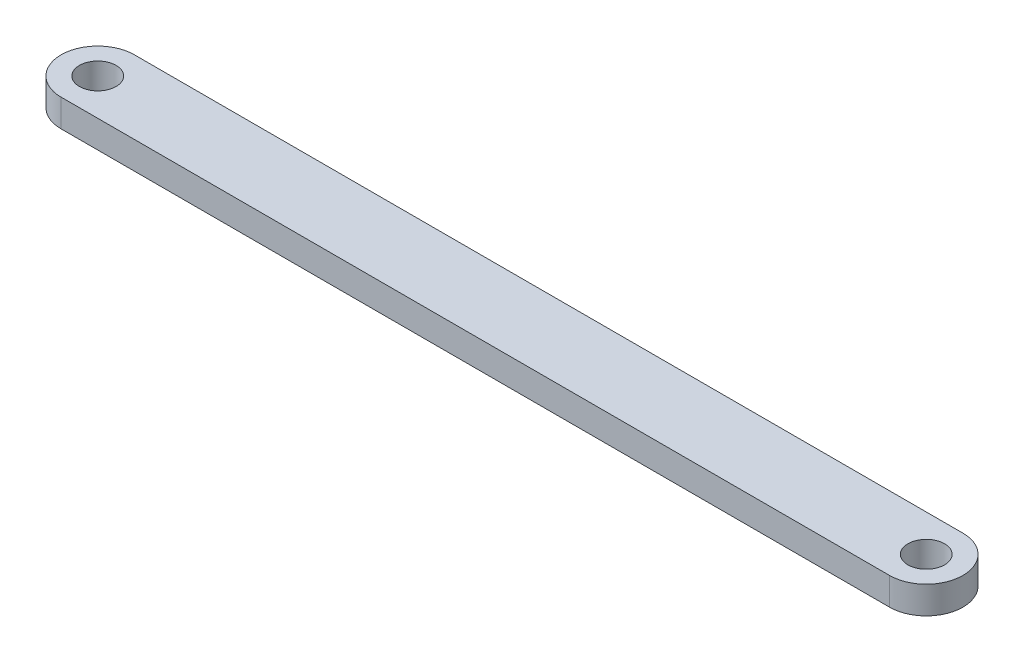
from build123d import *

# Parameters (mm, degrees)
SKIZZE2_R                       = 10
AUFSATZ_LINEAR_AUSTRAGEN1_DEPTH = 15


with BuildPart() as part:
    # Skizze2 → Aufsatz-Linear austragen1 (new body)
    with BuildSketch(Plane(origin=(0, 0, 0), x_dir=(1, 0, 0), z_dir=(0, 1, 0))):
        with BuildLine():
            Line((-452, -650), (0, -650))
            ThreePointArc((0, -650), (20, -670), (0, -690))
            Line((0, -690), (-452, -690))
            ThreePointArc((-452, -690), (-472, -670), (-452, -650))
        make_face()
        with Locations(Location((-452, -670, 0), (0, 0, 270))):
            Circle(SKIZZE2_R, mode=Mode.SUBTRACT)
        with Locations(Location((0, -670, 0), (0, 0, 270))):
            Circle(SKIZZE2_R, mode=Mode.SUBTRACT)
    extrude(amount=AUFSATZ_LINEAR_AUSTRAGEN1_DEPTH)


solid = part.part
